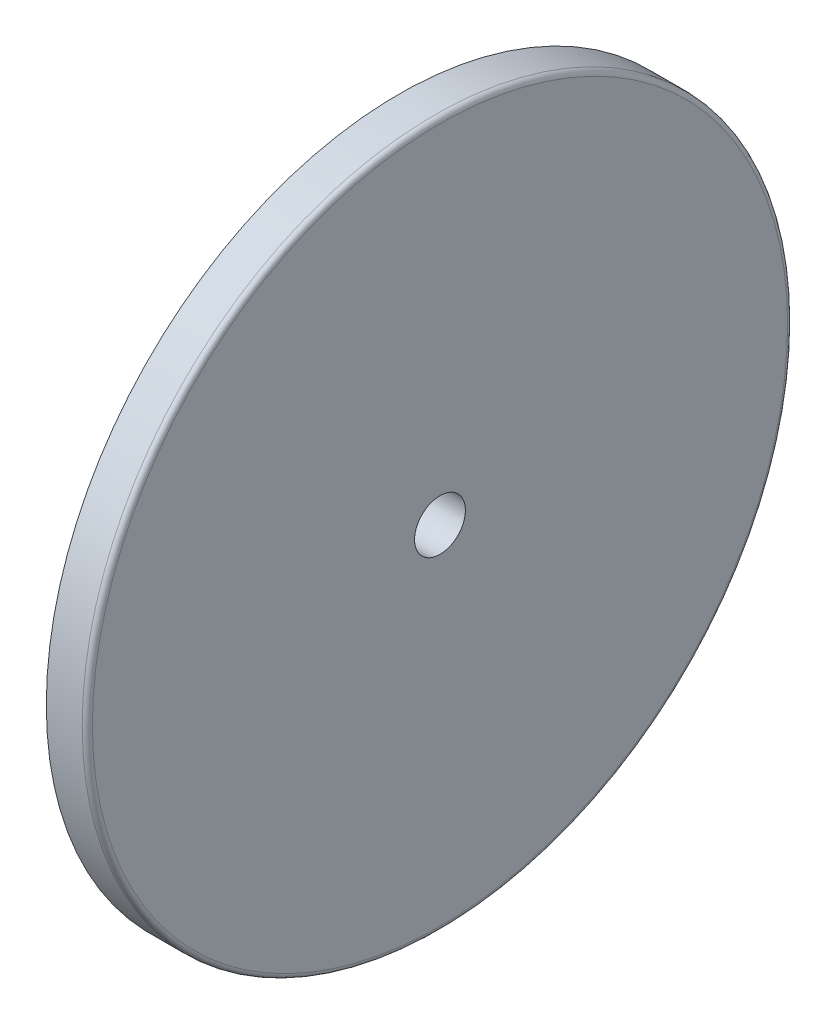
from build123d import *


with BuildPart() as part:
    # Sketch2 → Revolve1 (revolve)
    with BuildSketch(Plane.XY, mode=Mode.PRIVATE) as revolve1_sk:
        with BuildLine():
            Line((5.9944, 31.115), (5.9944, 31.369))
            Line((5.9944, 31.369), (5.7404, 31.369))
            Line((5.7404, 31.369), (5.7404, 36.6395))
            Line((5.7404, 36.6395), (10.0076, 36.6395))
            Line((10.0076, 36.6395), (10.0076, 54.102))
            Line((10.0076, 54.102), (5.0038, 54.102))
            Line((5.0038, 54.102), (5.0038, 55.0418))
            Line((5.0038, 55.0418), (10.60625, 55.0418))
            ThreePointArc((10.60625, 55.0418), (11.167516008, 54.809316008), (11.4, 54.24805))
            Line((11.4, 54.24805), (11.4, 3.96875))
            Line((11.4, 3.96875), (3.2512, 3.96875))
            Line((3.2512, 3.96875), (3.2512, 24.5745))
            ThreePointArc((3.2512, 24.5745), (3.483683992, 25.135766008), (4.04495, 25.36825))
            Line((4.04495, 25.36825), (5.97535, 25.36825))
            Line((5.97535, 25.36825), (5.97535, 31.115))
            Line((5.97535, 31.115), (5.9944, 31.115))
        make_face()
    revolve(revolve1_sk.sketch.rotate(Axis((0, 0, 0), (1, 0, 0)), 90), axis=Axis((0, 0, 0), (1, 0, 0)))


solid = part.part
